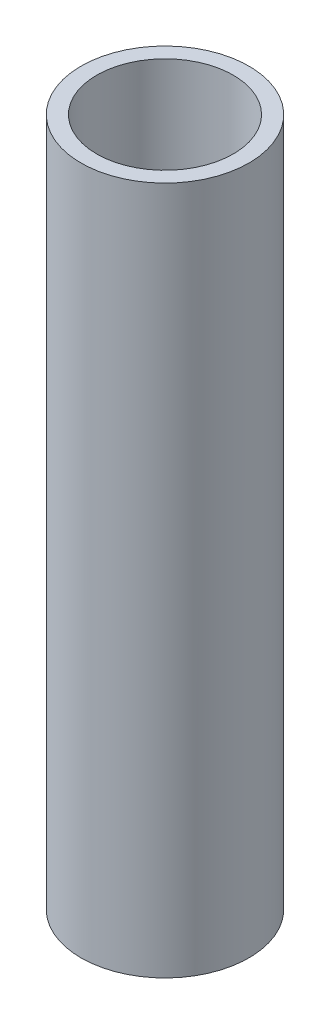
ISO-10303-21;
HEADER;
FILE_DESCRIPTION(('STEP AP214'),'2;1');
FILE_NAME('part.step','',(''),(''),'','','');
FILE_SCHEMA(('AUTOMOTIVE_DESIGN { 1 0 10303 214 1 1 1 1 }'));
ENDSEC;
DATA;
#1=APPLICATION_CONTEXT('core data for automotive mechanical design processes');
#2=APPLICATION_PROTOCOL_DEFINITION('international standard','automotive_design',2000,#1);
#3=PRODUCT_CONTEXT('',#1,'mechanical');
#4=PRODUCT('Part','Part','',(#3));
#5=PRODUCT_RELATED_PRODUCT_CATEGORY('part','',(#4));
#6=PRODUCT_DEFINITION_FORMATION('','',#4);
#7=PRODUCT_DEFINITION_CONTEXT('part definition',#1,'design');
#8=PRODUCT_DEFINITION('design','',#6,#7);
#9=PRODUCT_DEFINITION_SHAPE('','',#8);
#10=(LENGTH_UNIT() NAMED_UNIT(*) SI_UNIT(.MILLI.,.METRE.));
#11=(NAMED_UNIT(*) PLANE_ANGLE_UNIT() SI_UNIT($,.RADIAN.));
#12=(NAMED_UNIT(*) SI_UNIT($,.STERADIAN.) SOLID_ANGLE_UNIT());
#13=UNCERTAINTY_MEASURE_WITH_UNIT(LENGTH_MEASURE(1.E-05),#10,'distance_accuracy_value','');
#14=(GEOMETRIC_REPRESENTATION_CONTEXT(3) GLOBAL_UNCERTAINTY_ASSIGNED_CONTEXT((#13)) GLOBAL_UNIT_ASSIGNED_CONTEXT((#10,
#11,#12)) REPRESENTATION_CONTEXT('',''));
#15=CARTESIAN_POINT('',(0.,0.,0.));
#16=DIRECTION('',(0.,0.,1.));
#17=DIRECTION('',(1.,0.,0.));
#18=AXIS2_PLACEMENT_3D('',#15,#16,#17);
#19=CARTESIAN_POINT('',(0.,52.5126270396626,0.));
#20=DIRECTION('',(0.,-1.,0.));
#21=DIRECTION('',(0.,0.,-1.));
#22=AXIS2_PLACEMENT_3D('',#19,#20,#21);
#23=CYLINDRICAL_SURFACE('',#22,4.7625);
#24=CARTESIAN_POINT('',(0.,0.,0.));
#25=DIRECTION('',(0.,1.,0.));
#26=DIRECTION('',(0.,0.,1.));
#27=AXIS2_PLACEMENT_3D('',#24,#25,#26);
#28=CIRCLE('',#27,4.7625);
#29=CARTESIAN_POINT('',(0.,0.,4.7625));
#30=VERTEX_POINT('',#29);
#31=EDGE_CURVE('E43',#30,#30,#28,.T.);
#32=ORIENTED_EDGE('',*,*,#31,.T.);
#33=EDGE_LOOP('',(#32));
#34=FACE_BOUND('',#33,.T.);
#35=CARTESIAN_POINT('',(0.,39.0422428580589,0.));
#36=DIRECTION('',(0.,1.,0.));
#37=DIRECTION('',(-0.67662512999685,0.,0.736327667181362));
#38=AXIS2_PLACEMENT_3D('',#35,#36,#37);
#39=CIRCLE('',#38,4.7625);
#40=CARTESIAN_POINT('',(-3.22242718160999,39.0422428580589,3.50676051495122));
#41=VERTEX_POINT('',#40);
#42=EDGE_CURVE('E39',#41,#41,#39,.T.);
#43=ORIENTED_EDGE('',*,*,#42,.F.);
#44=EDGE_LOOP('',(#43));
#45=FACE_BOUND('',#44,.T.);
#46=ADVANCED_FACE('F33',(#34,#45),#23,.T.);
#47=CARTESIAN_POINT('',(0.,0.,0.));
#48=DIRECTION('',(0.,1.,0.));
#49=DIRECTION('',(0.,0.,1.));
#50=AXIS2_PLACEMENT_3D('',#47,#48,#49);
#51=PLANE('',#50);
#52=ORIENTED_EDGE('',*,*,#31,.F.);
#53=EDGE_LOOP('',(#52));
#54=FACE_BOUND('',#53,.T.);
#55=CARTESIAN_POINT('',(0.,0.,0.));
#56=DIRECTION('',(0.,1.,0.));
#57=DIRECTION('',(0.,0.,1.));
#58=AXIS2_PLACEMENT_3D('',#55,#56,#57);
#59=CIRCLE('',#58,3.8735);
#60=CARTESIAN_POINT('',(0.,0.,3.8735));
#61=VERTEX_POINT('',#60);
#62=EDGE_CURVE('E48',#61,#61,#59,.T.);
#63=ORIENTED_EDGE('',*,*,#62,.T.);
#64=EDGE_LOOP('',(#63));
#65=FACE_BOUND('',#64,.T.);
#66=ADVANCED_FACE('F53',(#54,#65),#51,.F.);
#67=CARTESIAN_POINT('',(0.,52.5126270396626,0.));
#68=DIRECTION('',(0.,-1.,0.));
#69=DIRECTION('',(0.,0.,-1.));
#70=AXIS2_PLACEMENT_3D('',#67,#68,#69);
#71=CYLINDRICAL_SURFACE('',#70,3.8735);
#72=ORIENTED_EDGE('',*,*,#62,.F.);
#73=EDGE_LOOP('',(#72));
#74=FACE_BOUND('',#73,.T.);
#75=CARTESIAN_POINT('',(0.,39.0422428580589,0.));
#76=DIRECTION('',(0.,1.,0.));
#77=DIRECTION('',(0.,0.,1.));
#78=AXIS2_PLACEMENT_3D('',#75,#76,#77);
#79=CIRCLE('',#78,3.8735);
#80=CARTESIAN_POINT('',(0.,39.0422428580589,3.8735));
#81=VERTEX_POINT('',#80);
#82=EDGE_CURVE('E10',#81,#81,#79,.T.);
#83=ORIENTED_EDGE('',*,*,#82,.T.);
#84=EDGE_LOOP('',(#83));
#85=FACE_BOUND('',#84,.T.);
#86=ADVANCED_FACE('F55',(#74,#85),#71,.F.);
#87=CARTESIAN_POINT('',(0.,39.0422428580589,0.));
#88=DIRECTION('',(0.,1.,0.));
#89=DIRECTION('',(-0.67662512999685,0.,0.736327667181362));
#90=AXIS2_PLACEMENT_3D('',#87,#88,#89);
#91=PLANE('',#90);
#92=ORIENTED_EDGE('',*,*,#82,.F.);
#93=EDGE_LOOP('',(#92));
#94=FACE_BOUND('',#93,.T.);
#95=ORIENTED_EDGE('',*,*,#42,.T.);
#96=EDGE_LOOP('',(#95));
#97=FACE_BOUND('',#96,.T.);
#98=ADVANCED_FACE('F57',(#94,#97),#91,.T.);
#99=CLOSED_SHELL('',(#46,#66,#86,#98));
#100=MANIFOLD_SOLID_BREP('B2',#99);
#101=ADVANCED_BREP_SHAPE_REPRESENTATION('',(#18,#100),#14);
#102=SHAPE_DEFINITION_REPRESENTATION(#9,#101);
ENDSEC;
END-ISO-10303-21;
